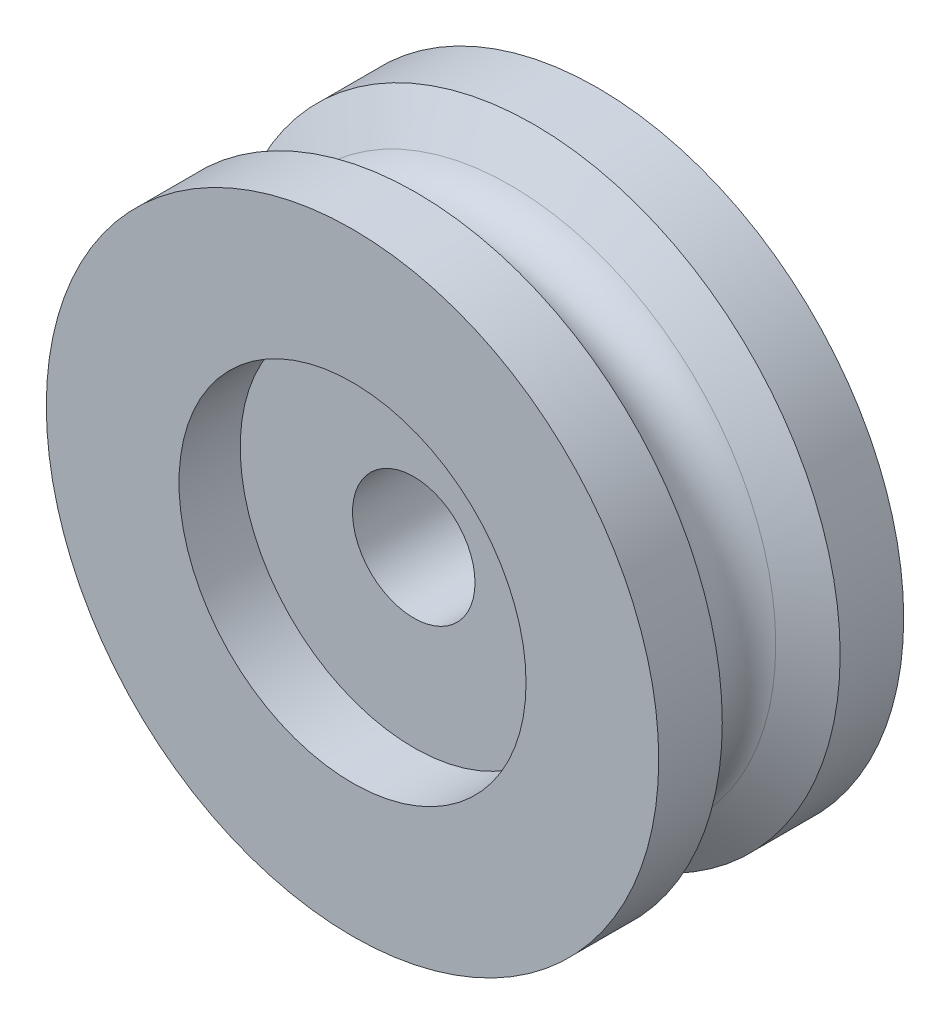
ISO-10303-21;
HEADER;
FILE_DESCRIPTION(('STEP AP214'),'2;1');
FILE_NAME('part.step','',(''),(''),'','','');
FILE_SCHEMA(('AUTOMOTIVE_DESIGN { 1 0 10303 214 1 1 1 1 }'));
ENDSEC;
DATA;
#1=APPLICATION_CONTEXT('core data for automotive mechanical design processes');
#2=APPLICATION_PROTOCOL_DEFINITION('international standard','automotive_design',2000,#1);
#3=PRODUCT_CONTEXT('',#1,'mechanical');
#4=PRODUCT('Part','Part','',(#3));
#5=PRODUCT_RELATED_PRODUCT_CATEGORY('part','',(#4));
#6=PRODUCT_DEFINITION_FORMATION('','',#4);
#7=PRODUCT_DEFINITION_CONTEXT('part definition',#1,'design');
#8=PRODUCT_DEFINITION('design','',#6,#7);
#9=PRODUCT_DEFINITION_SHAPE('','',#8);
#10=(LENGTH_UNIT() NAMED_UNIT(*) SI_UNIT(.MILLI.,.METRE.));
#11=(NAMED_UNIT(*) PLANE_ANGLE_UNIT() SI_UNIT($,.RADIAN.));
#12=(NAMED_UNIT(*) SI_UNIT($,.STERADIAN.) SOLID_ANGLE_UNIT());
#13=UNCERTAINTY_MEASURE_WITH_UNIT(LENGTH_MEASURE(1.E-05),#10,'distance_accuracy_value','');
#14=(GEOMETRIC_REPRESENTATION_CONTEXT(3) GLOBAL_UNCERTAINTY_ASSIGNED_CONTEXT((#13)) GLOBAL_UNIT_ASSIGNED_CONTEXT((#10,
#11,#12)) REPRESENTATION_CONTEXT('',''));
#15=CARTESIAN_POINT('',(0.,0.,0.));
#16=DIRECTION('',(0.,0.,1.));
#17=DIRECTION('',(1.,0.,0.));
#18=AXIS2_PLACEMENT_3D('',#15,#16,#17);
#19=CARTESIAN_POINT('',(0.,0.,-2.88675134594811));
#20=DIRECTION('',(0.,0.,-1.));
#21=DIRECTION('',(-1.,0.,0.));
#22=AXIS2_PLACEMENT_3D('',#19,#20,#21);
#23=CONICAL_SURFACE('',#22,15.,1.0471975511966);
#24=CARTESIAN_POINT('',(0.,0.,-1.73205080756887));
#25=DIRECTION('',(0.,0.,1.));
#26=DIRECTION('',(1.,0.,0.));
#27=AXIS2_PLACEMENT_3D('',#24,#25,#26);
#28=CIRCLE('',#27,13.);
#29=CARTESIAN_POINT('',(13.,0.,-1.73205080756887));
#30=VERTEX_POINT('',#29);
#31=EDGE_CURVE('E8',#30,#30,#28,.T.);
#32=ORIENTED_EDGE('',*,*,#31,.F.);
#33=EDGE_LOOP('',(#32));
#34=FACE_BOUND('',#33,.T.);
#35=CARTESIAN_POINT('',(0.,0.,-2.88675134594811));
#36=DIRECTION('',(0.,0.,1.));
#37=DIRECTION('',(1.,0.,0.));
#38=AXIS2_PLACEMENT_3D('',#35,#36,#37);
#39=CIRCLE('',#38,15.);
#40=CARTESIAN_POINT('',(15.,0.,-2.88675134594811));
#41=VERTEX_POINT('',#40);
#42=EDGE_CURVE('E52',#41,#41,#39,.T.);
#43=ORIENTED_EDGE('',*,*,#42,.T.);
#44=EDGE_LOOP('',(#43));
#45=FACE_BOUND('',#44,.T.);
#46=ADVANCED_FACE('F12',(#34,#45),#23,.T.);
#47=CARTESIAN_POINT('',(0.,0.,0.));
#48=DIRECTION('',(0.,0.,1.));
#49=DIRECTION('',(1.,0.,0.));
#50=AXIS2_PLACEMENT_3D('',#47,#48,#49);
#51=TOROIDAL_SURFACE('',#50,14.,2.);
#52=CARTESIAN_POINT('',(0.,0.,1.73205080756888));
#53=DIRECTION('',(0.,0.,1.));
#54=DIRECTION('',(1.,0.,0.));
#55=AXIS2_PLACEMENT_3D('',#52,#53,#54);
#56=CIRCLE('',#55,13.);
#57=CARTESIAN_POINT('',(13.,0.,1.73205080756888));
#58=VERTEX_POINT('',#57);
#59=EDGE_CURVE('E18',#58,#58,#56,.T.);
#60=ORIENTED_EDGE('',*,*,#59,.F.);
#61=EDGE_LOOP('',(#60));
#62=FACE_BOUND('',#61,.T.);
#63=ORIENTED_EDGE('',*,*,#31,.T.);
#64=EDGE_LOOP('',(#63));
#65=FACE_BOUND('',#64,.T.);
#66=ADVANCED_FACE('F113',(#62,#65),#51,.F.);
#67=CARTESIAN_POINT('',(0.,0.,1.73205080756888));
#68=DIRECTION('',(0.,0.,1.));
#69=DIRECTION('',(1.,0.,0.));
#70=AXIS2_PLACEMENT_3D('',#67,#68,#69);
#71=CONICAL_SURFACE('',#70,13.,1.0471975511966);
#72=CARTESIAN_POINT('',(0.,0.,2.88675134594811));
#73=DIRECTION('',(0.,0.,1.));
#74=DIRECTION('',(1.,0.,0.));
#75=AXIS2_PLACEMENT_3D('',#72,#73,#74);
#76=CIRCLE('',#75,15.);
#77=CARTESIAN_POINT('',(15.,0.,2.88675134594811));
#78=VERTEX_POINT('',#77);
#79=EDGE_CURVE('E22',#78,#78,#76,.T.);
#80=ORIENTED_EDGE('',*,*,#79,.F.);
#81=EDGE_LOOP('',(#80));
#82=FACE_BOUND('',#81,.T.);
#83=ORIENTED_EDGE('',*,*,#59,.T.);
#84=EDGE_LOOP('',(#83));
#85=FACE_BOUND('',#84,.T.);
#86=ADVANCED_FACE('F108',(#82,#85),#71,.T.);
#87=CARTESIAN_POINT('',(0.,0.,8.5891940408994));
#88=DIRECTION('',(0.,0.,1.));
#89=DIRECTION('',(1.,0.,0.));
#90=AXIS2_PLACEMENT_3D('',#87,#88,#89);
#91=CYLINDRICAL_SURFACE('',#90,15.);
#92=CARTESIAN_POINT('',(0.,0.,6.));
#93=DIRECTION('',(0.,0.,1.));
#94=DIRECTION('',(1.,0.,0.));
#95=AXIS2_PLACEMENT_3D('',#92,#93,#94);
#96=CIRCLE('',#95,15.);
#97=CARTESIAN_POINT('',(15.,0.,6.));
#98=VERTEX_POINT('',#97);
#99=EDGE_CURVE('E26',#98,#98,#96,.T.);
#100=ORIENTED_EDGE('',*,*,#99,.F.);
#101=EDGE_LOOP('',(#100));
#102=FACE_BOUND('',#101,.T.);
#103=ORIENTED_EDGE('',*,*,#79,.T.);
#104=EDGE_LOOP('',(#103));
#105=FACE_BOUND('',#104,.T.);
#106=ADVANCED_FACE('F102',(#102,#105),#91,.T.);
#107=CARTESIAN_POINT('',(0.,15.,6.));
#108=DIRECTION('',(0.,0.,-1.));
#109=DIRECTION('',(-1.,0.,0.));
#110=AXIS2_PLACEMENT_3D('',#107,#108,#109);
#111=PLANE('',#110);
#112=CARTESIAN_POINT('',(0.,0.,6.));
#113=DIRECTION('',(0.,0.,1.));
#114=DIRECTION('',(1.,0.,0.));
#115=AXIS2_PLACEMENT_3D('',#112,#113,#114);
#116=CIRCLE('',#115,8.5);
#117=CARTESIAN_POINT('',(8.5,0.,6.));
#118=VERTEX_POINT('',#117);
#119=EDGE_CURVE('E31',#118,#118,#116,.T.);
#120=ORIENTED_EDGE('',*,*,#119,.F.);
#121=EDGE_LOOP('',(#120));
#122=FACE_BOUND('',#121,.T.);
#123=ORIENTED_EDGE('',*,*,#99,.T.);
#124=EDGE_LOOP('',(#123));
#125=FACE_BOUND('',#124,.T.);
#126=ADVANCED_FACE('F96',(#122,#125),#111,.F.);
#127=CARTESIAN_POINT('',(0.,0.,8.5891940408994));
#128=DIRECTION('',(0.,0.,1.));
#129=DIRECTION('',(1.,0.,0.));
#130=AXIS2_PLACEMENT_3D('',#127,#128,#129);
#131=CYLINDRICAL_SURFACE('',#130,8.5);
#132=CARTESIAN_POINT('',(0.,0.,3.));
#133=DIRECTION('',(0.,0.,1.));
#134=DIRECTION('',(1.,0.,0.));
#135=AXIS2_PLACEMENT_3D('',#132,#133,#134);
#136=CIRCLE('',#135,8.5);
#137=CARTESIAN_POINT('',(8.5,0.,3.));
#138=VERTEX_POINT('',#137);
#139=EDGE_CURVE('E34',#138,#138,#136,.T.);
#140=ORIENTED_EDGE('',*,*,#139,.F.);
#141=EDGE_LOOP('',(#140));
#142=FACE_BOUND('',#141,.T.);
#143=ORIENTED_EDGE('',*,*,#119,.T.);
#144=EDGE_LOOP('',(#143));
#145=FACE_BOUND('',#144,.T.);
#146=ADVANCED_FACE('F90',(#142,#145),#131,.F.);
#147=CARTESIAN_POINT('',(0.,8.5,3.));
#148=DIRECTION('',(0.,0.,-1.));
#149=DIRECTION('',(-1.,0.,0.));
#150=AXIS2_PLACEMENT_3D('',#147,#148,#149);
#151=PLANE('',#150);
#152=CARTESIAN_POINT('',(0.,0.,3.));
#153=DIRECTION('',(0.,0.,1.));
#154=DIRECTION('',(1.,0.,0.));
#155=AXIS2_PLACEMENT_3D('',#152,#153,#154);
#156=CIRCLE('',#155,3.);
#157=CARTESIAN_POINT('',(3.,0.,3.));
#158=VERTEX_POINT('',#157);
#159=EDGE_CURVE('E37',#158,#158,#156,.T.);
#160=ORIENTED_EDGE('',*,*,#159,.F.);
#161=EDGE_LOOP('',(#160));
#162=FACE_BOUND('',#161,.T.);
#163=ORIENTED_EDGE('',*,*,#139,.T.);
#164=EDGE_LOOP('',(#163));
#165=FACE_BOUND('',#164,.T.);
#166=ADVANCED_FACE('F84',(#162,#165),#151,.F.);
#167=CARTESIAN_POINT('',(0.,0.,8.5891940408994));
#168=DIRECTION('',(0.,0.,1.));
#169=DIRECTION('',(1.,0.,0.));
#170=AXIS2_PLACEMENT_3D('',#167,#168,#169);
#171=CYLINDRICAL_SURFACE('',#170,3.);
#172=CARTESIAN_POINT('',(0.,0.,-3.));
#173=DIRECTION('',(0.,0.,1.));
#174=DIRECTION('',(1.,0.,0.));
#175=AXIS2_PLACEMENT_3D('',#172,#173,#174);
#176=CIRCLE('',#175,3.);
#177=CARTESIAN_POINT('',(3.,0.,-3.));
#178=VERTEX_POINT('',#177);
#179=EDGE_CURVE('E40',#178,#178,#176,.T.);
#180=ORIENTED_EDGE('',*,*,#179,.F.);
#181=EDGE_LOOP('',(#180));
#182=FACE_BOUND('',#181,.T.);
#183=ORIENTED_EDGE('',*,*,#159,.T.);
#184=EDGE_LOOP('',(#183));
#185=FACE_BOUND('',#184,.T.);
#186=ADVANCED_FACE('F78',(#182,#185),#171,.F.);
#187=CARTESIAN_POINT('',(0.,3.,-3.));
#188=DIRECTION('',(0.,0.,1.));
#189=DIRECTION('',(1.,0.,0.));
#190=AXIS2_PLACEMENT_3D('',#187,#188,#189);
#191=PLANE('',#190);
#192=CARTESIAN_POINT('',(0.,0.,-3.));
#193=DIRECTION('',(0.,0.,1.));
#194=DIRECTION('',(1.,0.,0.));
#195=AXIS2_PLACEMENT_3D('',#192,#193,#194);
#196=CIRCLE('',#195,6.5);
#197=CARTESIAN_POINT('',(6.5,0.,-3.));
#198=VERTEX_POINT('',#197);
#199=EDGE_CURVE('E43',#198,#198,#196,.T.);
#200=ORIENTED_EDGE('',*,*,#199,.F.);
#201=EDGE_LOOP('',(#200));
#202=FACE_BOUND('',#201,.T.);
#203=ORIENTED_EDGE('',*,*,#179,.T.);
#204=EDGE_LOOP('',(#203));
#205=FACE_BOUND('',#204,.T.);
#206=ADVANCED_FACE('F72',(#202,#205),#191,.F.);
#207=CARTESIAN_POINT('',(0.,0.,8.5891940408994));
#208=DIRECTION('',(0.,0.,1.));
#209=DIRECTION('',(1.,0.,0.));
#210=AXIS2_PLACEMENT_3D('',#207,#208,#209);
#211=CYLINDRICAL_SURFACE('',#210,6.5);
#212=CARTESIAN_POINT('',(0.,0.,-6.));
#213=DIRECTION('',(0.,0.,1.));
#214=DIRECTION('',(1.,0.,0.));
#215=AXIS2_PLACEMENT_3D('',#212,#213,#214);
#216=CIRCLE('',#215,6.5);
#217=CARTESIAN_POINT('',(6.5,0.,-6.));
#218=VERTEX_POINT('',#217);
#219=EDGE_CURVE('E46',#218,#218,#216,.T.);
#220=ORIENTED_EDGE('',*,*,#219,.F.);
#221=EDGE_LOOP('',(#220));
#222=FACE_BOUND('',#221,.T.);
#223=ORIENTED_EDGE('',*,*,#199,.T.);
#224=EDGE_LOOP('',(#223));
#225=FACE_BOUND('',#224,.T.);
#226=ADVANCED_FACE('F66',(#222,#225),#211,.F.);
#227=CARTESIAN_POINT('',(0.,6.5,-6.));
#228=DIRECTION('',(0.,0.,1.));
#229=DIRECTION('',(1.,0.,0.));
#230=AXIS2_PLACEMENT_3D('',#227,#228,#229);
#231=PLANE('',#230);
#232=CARTESIAN_POINT('',(0.,0.,-6.));
#233=DIRECTION('',(0.,0.,1.));
#234=DIRECTION('',(1.,0.,0.));
#235=AXIS2_PLACEMENT_3D('',#232,#233,#234);
#236=CIRCLE('',#235,15.);
#237=CARTESIAN_POINT('',(15.,0.,-6.));
#238=VERTEX_POINT('',#237);
#239=EDGE_CURVE('E49',#238,#238,#236,.T.);
#240=ORIENTED_EDGE('',*,*,#239,.F.);
#241=EDGE_LOOP('',(#240));
#242=FACE_BOUND('',#241,.T.);
#243=ORIENTED_EDGE('',*,*,#219,.T.);
#244=EDGE_LOOP('',(#243));
#245=FACE_BOUND('',#244,.T.);
#246=ADVANCED_FACE('F60',(#242,#245),#231,.F.);
#247=CARTESIAN_POINT('',(0.,0.,8.5891940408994));
#248=DIRECTION('',(0.,0.,1.));
#249=DIRECTION('',(1.,0.,0.));
#250=AXIS2_PLACEMENT_3D('',#247,#248,#249);
#251=CYLINDRICAL_SURFACE('',#250,15.);
#252=ORIENTED_EDGE('',*,*,#42,.F.);
#253=EDGE_LOOP('',(#252));
#254=FACE_BOUND('',#253,.T.);
#255=ORIENTED_EDGE('',*,*,#239,.T.);
#256=EDGE_LOOP('',(#255));
#257=FACE_BOUND('',#256,.T.);
#258=ADVANCED_FACE('F57',(#254,#257),#251,.T.);
#259=CLOSED_SHELL('',(#46,#66,#86,#106,#126,#146,#166,#186,#206,#226,#246,#258));
#260=MANIFOLD_SOLID_BREP('B1',#259);
#261=ADVANCED_BREP_SHAPE_REPRESENTATION('',(#18,#260),#14);
#262=SHAPE_DEFINITION_REPRESENTATION(#9,#261);
ENDSEC;
END-ISO-10303-21;
